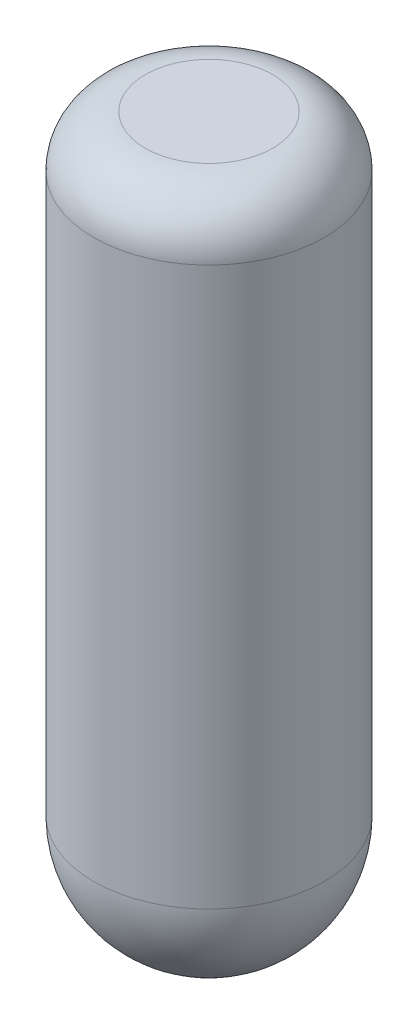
ISO-10303-21;
HEADER;
FILE_DESCRIPTION(('STEP AP214'),'2;1');
FILE_NAME('part.step','',(''),(''),'','','');
FILE_SCHEMA(('AUTOMOTIVE_DESIGN { 1 0 10303 214 1 1 1 1 }'));
ENDSEC;
DATA;
#1=APPLICATION_CONTEXT('core data for automotive mechanical design processes');
#2=APPLICATION_PROTOCOL_DEFINITION('international standard','automotive_design',2000,#1);
#3=PRODUCT_CONTEXT('',#1,'mechanical');
#4=PRODUCT('Part','Part','',(#3));
#5=PRODUCT_RELATED_PRODUCT_CATEGORY('part','',(#4));
#6=PRODUCT_DEFINITION_FORMATION('','',#4);
#7=PRODUCT_DEFINITION_CONTEXT('part definition',#1,'design');
#8=PRODUCT_DEFINITION('design','',#6,#7);
#9=PRODUCT_DEFINITION_SHAPE('','',#8);
#10=(LENGTH_UNIT() NAMED_UNIT(*) SI_UNIT(.MILLI.,.METRE.));
#11=(NAMED_UNIT(*) PLANE_ANGLE_UNIT() SI_UNIT($,.RADIAN.));
#12=(NAMED_UNIT(*) SI_UNIT($,.STERADIAN.) SOLID_ANGLE_UNIT());
#13=UNCERTAINTY_MEASURE_WITH_UNIT(LENGTH_MEASURE(1.E-05),#10,'distance_accuracy_value','');
#14=(GEOMETRIC_REPRESENTATION_CONTEXT(3) GLOBAL_UNCERTAINTY_ASSIGNED_CONTEXT((#13)) GLOBAL_UNIT_ASSIGNED_CONTEXT((#10,
#11,#12)) REPRESENTATION_CONTEXT('',''));
#15=CARTESIAN_POINT('',(0.,0.,0.));
#16=DIRECTION('',(0.,0.,1.));
#17=DIRECTION('',(1.,0.,0.));
#18=AXIS2_PLACEMENT_3D('',#15,#16,#17);
#19=CARTESIAN_POINT('',(0.,324.085692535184,0.));
#20=DIRECTION('',(0.,1.,0.));
#21=DIRECTION('',(0.,0.,1.));
#22=AXIS2_PLACEMENT_3D('',#19,#20,#21);
#23=TOROIDAL_SURFACE('',#22,37.9581441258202,30.6843827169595);
#24=CARTESIAN_POINT('',(0.,354.770075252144,0.));
#25=DIRECTION('',(0.,1.,0.));
#26=DIRECTION('',(0.,0.,1.));
#27=AXIS2_PLACEMENT_3D('',#24,#25,#26);
#28=CIRCLE('',#27,37.9581441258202);
#29=CARTESIAN_POINT('',(0.,354.770075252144,37.9581441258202));
#30=VERTEX_POINT('',#29);
#31=EDGE_CURVE('E10',#30,#30,#28,.T.);
#32=ORIENTED_EDGE('',*,*,#31,.F.);
#33=EDGE_LOOP('',(#32));
#34=FACE_BOUND('',#33,.T.);
#35=CARTESIAN_POINT('',(0.,324.085692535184,0.));
#36=DIRECTION('',(0.,1.,0.));
#37=DIRECTION('',(0.,0.,1.));
#38=AXIS2_PLACEMENT_3D('',#35,#36,#37);
#39=CIRCLE('',#38,68.6425268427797);
#40=CARTESIAN_POINT('',(0.,324.085692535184,68.6425268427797));
#41=VERTEX_POINT('',#40);
#42=EDGE_CURVE('E39',#41,#41,#39,.T.);
#43=ORIENTED_EDGE('',*,*,#42,.T.);
#44=EDGE_LOOP('',(#43));
#45=FACE_BOUND('',#44,.T.);
#46=ADVANCED_FACE('F29',(#34,#45),#23,.T.);
#47=CARTESIAN_POINT('',(37.9581441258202,354.770075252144,0.));
#48=DIRECTION('',(0.,-1.,0.));
#49=DIRECTION('',(0.,0.,-1.));
#50=AXIS2_PLACEMENT_3D('',#47,#48,#49);
#51=PLANE('',#50);
#52=ORIENTED_EDGE('',*,*,#31,.T.);
#53=EDGE_LOOP('',(#52));
#54=FACE_BOUND('',#53,.T.);
#55=ADVANCED_FACE('F54',(#54),#51,.F.);
#56=CARTESIAN_POINT('',(0.,-7.81685423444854,0.));
#57=DIRECTION('',(0.,1.,0.));
#58=DIRECTION('',(-1.,0.,0.));
#59=AXIS2_PLACEMENT_3D('',#56,#57,#58);
#60=SPHERICAL_SURFACE('',#59,68.6425268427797);
#61=CARTESIAN_POINT('',(0.,-7.81685423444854,0.));
#62=DIRECTION('',(0.,1.,0.));
#63=DIRECTION('',(0.,0.,1.));
#64=AXIS2_PLACEMENT_3D('',#61,#62,#63);
#65=CIRCLE('',#64,68.6425268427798);
#66=CARTESIAN_POINT('',(0.,-7.81685423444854,68.6425268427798));
#67=VERTEX_POINT('',#66);
#68=EDGE_CURVE('E35',#67,#67,#65,.T.);
#69=ORIENTED_EDGE('',*,*,#68,.F.);
#70=EDGE_LOOP('',(#69));
#71=FACE_BOUND('',#70,.T.);
#72=ADVANCED_FACE('F49',(#71),#60,.T.);
#73=CARTESIAN_POINT('',(0.,67.5728442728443,0.));
#74=DIRECTION('',(0.,1.,0.));
#75=DIRECTION('',(0.,0.,1.));
#76=AXIS2_PLACEMENT_3D('',#73,#74,#75);
#77=CYLINDRICAL_SURFACE('',#76,68.6425268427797);
#78=ORIENTED_EDGE('',*,*,#42,.F.);
#79=EDGE_LOOP('',(#78));
#80=FACE_BOUND('',#79,.T.);
#81=ORIENTED_EDGE('',*,*,#68,.T.);
#82=EDGE_LOOP('',(#81));
#83=FACE_BOUND('',#82,.T.);
#84=ADVANCED_FACE('F47',(#80,#83),#77,.T.);
#85=CLOSED_SHELL('',(#46,#55,#72,#84));
#86=MANIFOLD_SOLID_BREP('B2',#85);
#87=ADVANCED_BREP_SHAPE_REPRESENTATION('',(#18,#86),#14);
#88=SHAPE_DEFINITION_REPRESENTATION(#9,#87);
ENDSEC;
END-ISO-10303-21;
